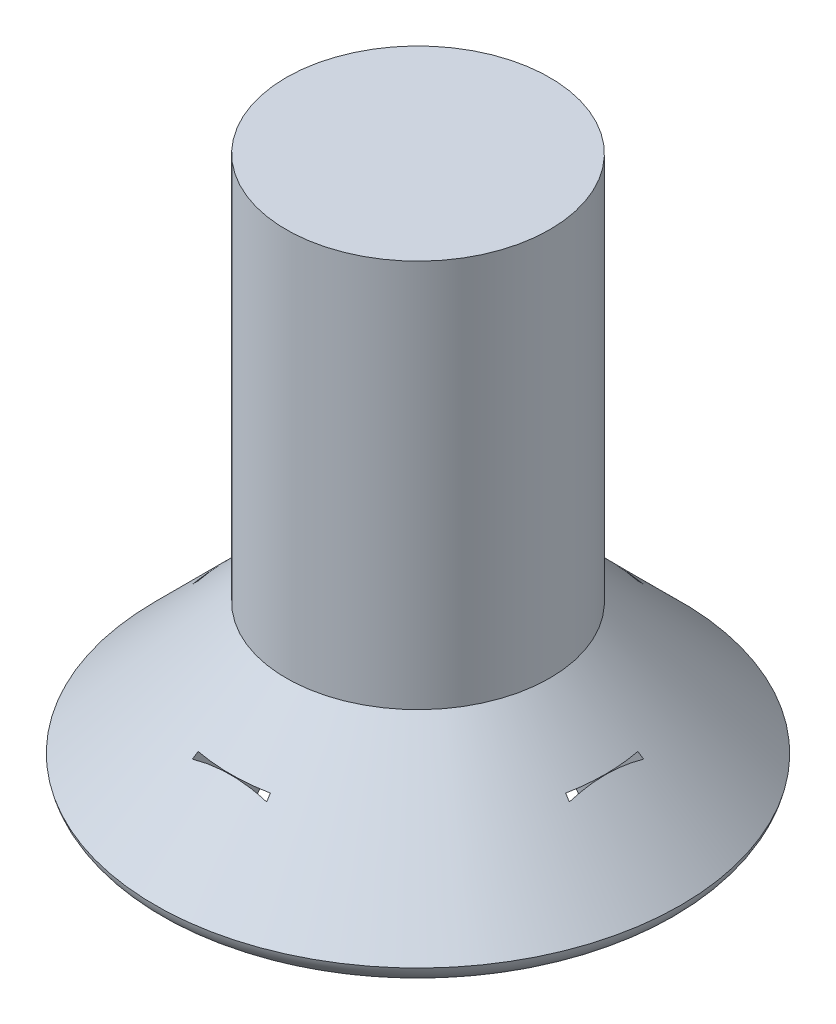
from build123d import *

# Parameters (mm, degrees)
ENL_V_MAT_EXTRU_1_DEPTH = 0.7
ENL_V_MAT_EXTRU_1_DRAFT = -12


with BuildPart() as part:
    # Esquisse1 → Base-R_volution (revolve)
    with BuildSketch(Plane.XY):
        with BuildLine():
            Line((0, 0), (1.69939172, 0))
            ThreePointArc((1.69939172, 0), (1.824303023, 0.043318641), (1.894895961, 0.155104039))
            Line((1.894895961, 0.155104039), (0.95, 1.1))
            Line((0.95, 1.1), (0.95, 3.9))
            Line((0.95, 3.9), (0, 3.9))
            Line((0, 3.9), (0, 0))
        make_face()
    revolve(axis=Axis((0, 0, 0), (0, 1, 0)))


with BuildPart() as enl_v_mat_extru_1_tool:
    # Esquisse2 → Enl_v. mat.-Extru.1 (with draft: the straight prism first)
    with BuildSketch(Plane.XZ):
        with BuildLine():
            Line((0.409041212, -1.5), (0.409041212, -0.941832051))
            ThreePointArc((0.409041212, -0.941832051), (0.565092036, -0.565092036), (0.941832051, -0.409041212))
            Line((0.941832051, -0.409041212), (1.5, -0.409041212))
            Line((1.5, -0.409041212), (1.5, 0.409041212))
            Line((1.5, 0.409041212), (0.941832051, 0.409041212))
            ThreePointArc((0.941832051, 0.409041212), (0.565092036, 0.565092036), (0.409041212, 0.941832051))
            Line((0.409041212, 0.941832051), (0.409041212, 1.5))
            Line((0.409041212, 1.5), (-0.409041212, 1.5))
            Line((-0.409041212, 1.5), (-0.409041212, 0.941832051))
            ThreePointArc((-0.409041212, 0.941832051), (-0.565092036, 0.565092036), (-0.941832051, 0.409041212))
            Line((-0.941832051, 0.409041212), (-1.5, 0.409041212))
            Line((-1.5, 0.409041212), (-1.5, -0.409041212))
            Line((-1.5, -0.409041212), (-0.941832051, -0.409041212))
            ThreePointArc((-0.941832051, -0.409041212), (-0.565092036, -0.565092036), (-0.409041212, -0.941832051))
            Line((-0.409041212, -0.941832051), (-0.409041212, -1.5))
            Line((-0.409041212, -1.5), (0.409041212, -1.5))
        make_face()
    extrude(amount=-ENL_V_MAT_EXTRU_1_DEPTH)
    # Enl_v. mat.-Extru.1: the draft: its side faces are tilted about the plane it starts from
    enl_v_mat_extru_1_sides = [enl_v_mat_extru_1_tool.faces().sort_by_distance(p)[0] for p in [
        (-1.220916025, 0.35, 0.409041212),
        (-1.5, 0.35, 0),
        (-1.220916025, 0.35, -0.409041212),
        (-0.565092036, 0.35, -0.565092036),
        (-0.409041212, 0.35, -1.220916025),
        (0, 0.35, -1.5),
        (0.409041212, 0.35, -1.220916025),
        (0.565092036, 0.35, -0.565092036),
        (1.220916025, 0.35, -0.409041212),
        (1.5, 0.35, 0),
        (1.220916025, 0.35, 0.409041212),
        (0.565092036, 0.35, 0.565092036),
        (0.409041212, 0.35, 1.220916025),
        (0, 0.35, 1.5),
        (-0.409041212, 0.35, 1.220916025),
        (-0.565092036, 0.35, 0.565092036),
    ]]
    draft(enl_v_mat_extru_1_sides, Plane.XZ, ENL_V_MAT_EXTRU_1_DRAFT)


with BuildPart() as part_1:
    add(part.part)

    # Enl_v. mat.-Extru.1: cut by enl_v_mat_extru_1_tool
    add(enl_v_mat_extru_1_tool.part, mode=Mode.SUBTRACT)


solid = part_1.part
